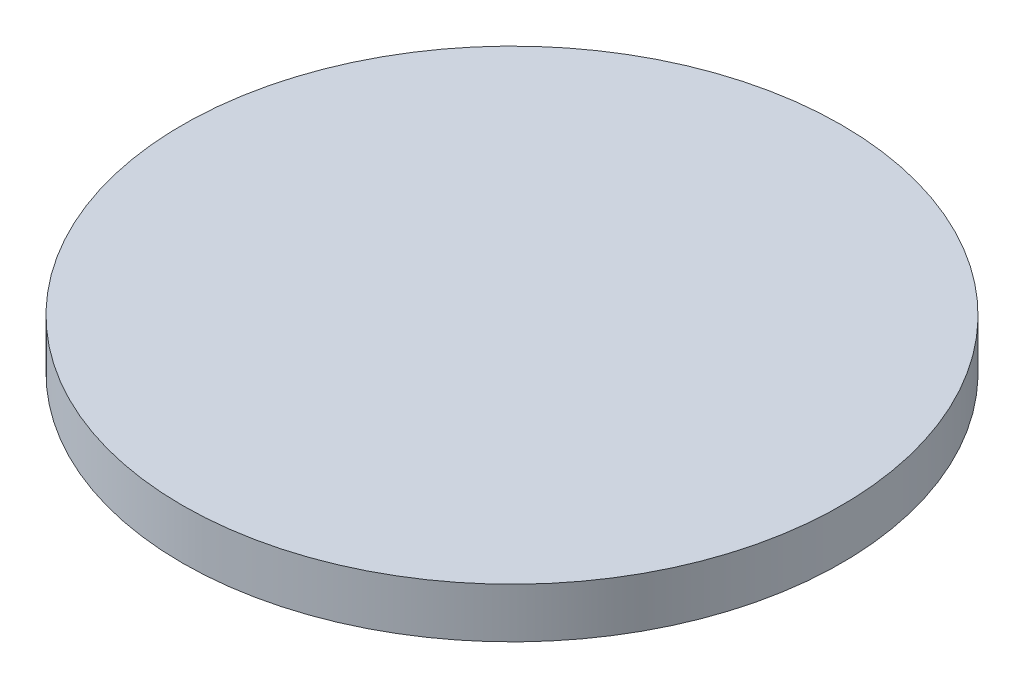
ISO-10303-21;
HEADER;
FILE_DESCRIPTION(('STEP AP214'),'2;1');
FILE_NAME('part.step','',(''),(''),'','','');
FILE_SCHEMA(('AUTOMOTIVE_DESIGN { 1 0 10303 214 1 1 1 1 }'));
ENDSEC;
DATA;
#1=APPLICATION_CONTEXT('core data for automotive mechanical design processes');
#2=APPLICATION_PROTOCOL_DEFINITION('international standard','automotive_design',2000,#1);
#3=PRODUCT_CONTEXT('',#1,'mechanical');
#4=PRODUCT('Part','Part','',(#3));
#5=PRODUCT_RELATED_PRODUCT_CATEGORY('part','',(#4));
#6=PRODUCT_DEFINITION_FORMATION('','',#4);
#7=PRODUCT_DEFINITION_CONTEXT('part definition',#1,'design');
#8=PRODUCT_DEFINITION('design','',#6,#7);
#9=PRODUCT_DEFINITION_SHAPE('','',#8);
#10=(LENGTH_UNIT() NAMED_UNIT(*) SI_UNIT(.MILLI.,.METRE.));
#11=(NAMED_UNIT(*) PLANE_ANGLE_UNIT() SI_UNIT($,.RADIAN.));
#12=(NAMED_UNIT(*) SI_UNIT($,.STERADIAN.) SOLID_ANGLE_UNIT());
#13=UNCERTAINTY_MEASURE_WITH_UNIT(LENGTH_MEASURE(1.E-05),#10,'distance_accuracy_value','');
#14=(GEOMETRIC_REPRESENTATION_CONTEXT(3) GLOBAL_UNCERTAINTY_ASSIGNED_CONTEXT((#13)) GLOBAL_UNIT_ASSIGNED_CONTEXT((#10,
#11,#12)) REPRESENTATION_CONTEXT('',''));
#15=CARTESIAN_POINT('',(0.,0.,0.));
#16=DIRECTION('',(0.,0.,1.));
#17=DIRECTION('',(1.,0.,0.));
#18=AXIS2_PLACEMENT_3D('',#15,#16,#17);
#19=CARTESIAN_POINT('',(0.,3.175,0.));
#20=DIRECTION('',(0.,-1.,0.));
#21=DIRECTION('',(0.,0.,-1.));
#22=AXIS2_PLACEMENT_3D('',#19,#20,#21);
#23=CYLINDRICAL_SURFACE('',#22,20.955);
#24=CARTESIAN_POINT('',(0.,3.175,0.));
#25=DIRECTION('',(0.,1.,0.));
#26=DIRECTION('',(0.,0.,1.));
#27=AXIS2_PLACEMENT_3D('',#24,#25,#26);
#28=CIRCLE('',#27,20.955);
#29=CARTESIAN_POINT('',(0.,3.175,20.955));
#30=VERTEX_POINT('',#29);
#31=EDGE_CURVE('E10',#30,#30,#28,.T.);
#32=ORIENTED_EDGE('',*,*,#31,.F.);
#33=EDGE_LOOP('',(#32));
#34=FACE_BOUND('',#33,.T.);
#35=CARTESIAN_POINT('',(0.,0.,0.));
#36=DIRECTION('',(0.,1.,0.));
#37=DIRECTION('',(0.,0.,1.));
#38=AXIS2_PLACEMENT_3D('',#35,#36,#37);
#39=CIRCLE('',#38,20.955);
#40=CARTESIAN_POINT('',(0.,0.,20.955));
#41=VERTEX_POINT('',#40);
#42=EDGE_CURVE('E40',#41,#41,#39,.T.);
#43=ORIENTED_EDGE('',*,*,#42,.T.);
#44=EDGE_LOOP('',(#43));
#45=FACE_BOUND('',#44,.T.);
#46=ADVANCED_FACE('F34',(#34,#45),#23,.T.);
#47=CARTESIAN_POINT('',(0.,3.175,0.));
#48=DIRECTION('',(0.,1.,0.));
#49=DIRECTION('',(0.,0.,1.));
#50=AXIS2_PLACEMENT_3D('',#47,#48,#49);
#51=PLANE('',#50);
#52=ORIENTED_EDGE('',*,*,#31,.T.);
#53=EDGE_LOOP('',(#52));
#54=FACE_BOUND('',#53,.T.);
#55=ADVANCED_FACE('F49',(#54),#51,.T.);
#56=CARTESIAN_POINT('',(0.,0.,0.));
#57=DIRECTION('',(0.,1.,0.));
#58=DIRECTION('',(0.,0.,1.));
#59=AXIS2_PLACEMENT_3D('',#56,#57,#58);
#60=PLANE('',#59);
#61=ORIENTED_EDGE('',*,*,#42,.F.);
#62=EDGE_LOOP('',(#61));
#63=FACE_BOUND('',#62,.T.);
#64=ADVANCED_FACE('F47',(#63),#60,.F.);
#65=CLOSED_SHELL('',(#46,#55,#64));
#66=MANIFOLD_SOLID_BREP('B2',#65);
#67=ADVANCED_BREP_SHAPE_REPRESENTATION('',(#18,#66),#14);
#68=SHAPE_DEFINITION_REPRESENTATION(#9,#67);
ENDSEC;
END-ISO-10303-21;
